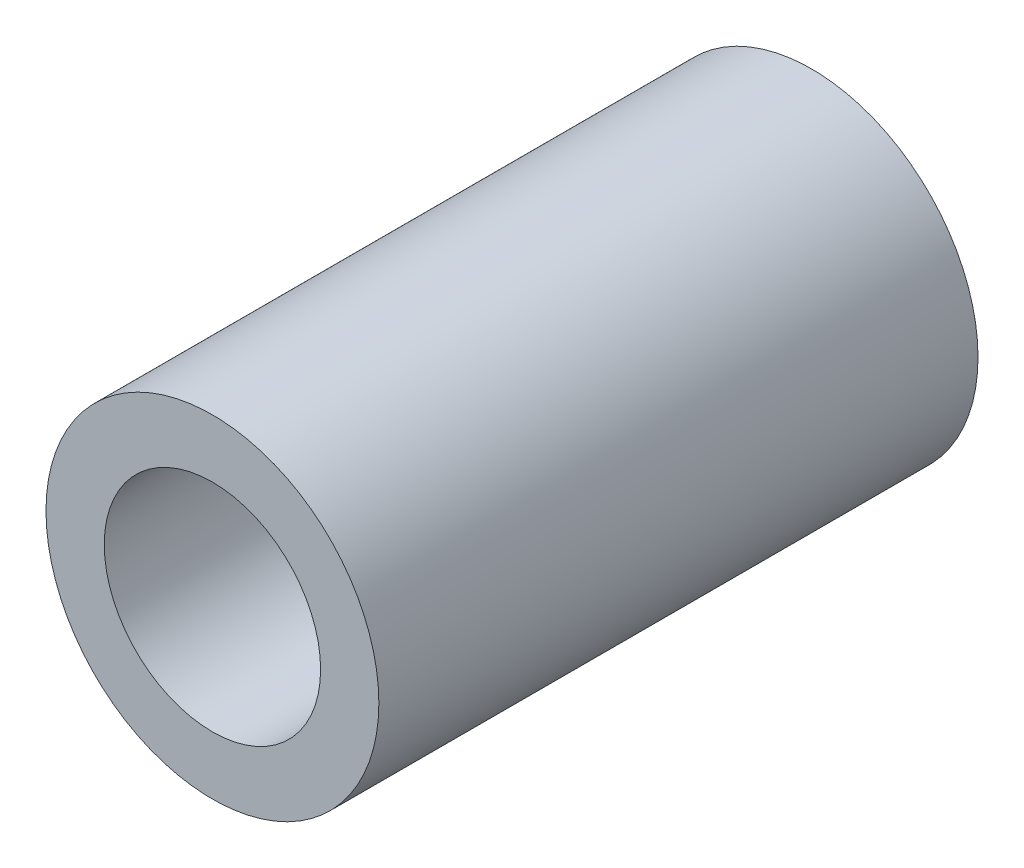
ISO-10303-21;
HEADER;
FILE_DESCRIPTION(('STEP AP214'),'2;1');
FILE_NAME('part.step','',(''),(''),'','','');
FILE_SCHEMA(('AUTOMOTIVE_DESIGN { 1 0 10303 214 1 1 1 1 }'));
ENDSEC;
DATA;
#1=APPLICATION_CONTEXT('core data for automotive mechanical design processes');
#2=APPLICATION_PROTOCOL_DEFINITION('international standard','automotive_design',2000,#1);
#3=PRODUCT_CONTEXT('',#1,'mechanical');
#4=PRODUCT('Part','Part','',(#3));
#5=PRODUCT_RELATED_PRODUCT_CATEGORY('part','',(#4));
#6=PRODUCT_DEFINITION_FORMATION('','',#4);
#7=PRODUCT_DEFINITION_CONTEXT('part definition',#1,'design');
#8=PRODUCT_DEFINITION('design','',#6,#7);
#9=PRODUCT_DEFINITION_SHAPE('','',#8);
#10=(LENGTH_UNIT() NAMED_UNIT(*) SI_UNIT(.MILLI.,.METRE.));
#11=(NAMED_UNIT(*) PLANE_ANGLE_UNIT() SI_UNIT($,.RADIAN.));
#12=(NAMED_UNIT(*) SI_UNIT($,.STERADIAN.) SOLID_ANGLE_UNIT());
#13=UNCERTAINTY_MEASURE_WITH_UNIT(LENGTH_MEASURE(1.E-05),#10,'distance_accuracy_value','');
#14=(GEOMETRIC_REPRESENTATION_CONTEXT(3) GLOBAL_UNCERTAINTY_ASSIGNED_CONTEXT((#13)) GLOBAL_UNIT_ASSIGNED_CONTEXT((#10,
#11,#12)) REPRESENTATION_CONTEXT('',''));
#15=CARTESIAN_POINT('',(0.,0.,0.));
#16=DIRECTION('',(0.,0.,1.));
#17=DIRECTION('',(1.,0.,0.));
#18=AXIS2_PLACEMENT_3D('',#15,#16,#17);
#19=CARTESIAN_POINT('',(0.,0.,18.));
#20=DIRECTION('',(0.,0.,1.));
#21=DIRECTION('',(1.,0.,0.));
#22=AXIS2_PLACEMENT_3D('',#19,#20,#21);
#23=PLANE('',#22);
#24=CARTESIAN_POINT('',(0.,0.,18.));
#25=DIRECTION('',(0.,0.,1.));
#26=DIRECTION('',(1.,0.,0.));
#27=AXIS2_PLACEMENT_3D('',#24,#25,#26);
#28=CIRCLE('',#27,5.);
#29=CARTESIAN_POINT('',(5.,0.,18.));
#30=VERTEX_POINT('',#29);
#31=EDGE_CURVE('E10',#30,#30,#28,.T.);
#32=ORIENTED_EDGE('',*,*,#31,.T.);
#33=EDGE_LOOP('',(#32));
#34=FACE_BOUND('',#33,.T.);
#35=CARTESIAN_POINT('',(0.,0.,18.));
#36=DIRECTION('',(0.,0.,1.));
#37=DIRECTION('',(1.,0.,0.));
#38=AXIS2_PLACEMENT_3D('',#35,#36,#37);
#39=CIRCLE('',#38,3.25);
#40=CARTESIAN_POINT('',(3.25,0.,18.));
#41=VERTEX_POINT('',#40);
#42=EDGE_CURVE('E40',#41,#41,#39,.T.);
#43=ORIENTED_EDGE('',*,*,#42,.F.);
#44=EDGE_LOOP('',(#43));
#45=FACE_BOUND('',#44,.T.);
#46=ADVANCED_FACE('F29',(#34,#45),#23,.T.);
#47=CARTESIAN_POINT('',(0.,0.,0.));
#48=DIRECTION('',(0.,0.,1.));
#49=DIRECTION('',(1.,0.,0.));
#50=AXIS2_PLACEMENT_3D('',#47,#48,#49);
#51=PLANE('',#50);
#52=CARTESIAN_POINT('',(0.,0.,0.));
#53=DIRECTION('',(0.,0.,1.));
#54=DIRECTION('',(1.,0.,0.));
#55=AXIS2_PLACEMENT_3D('',#52,#53,#54);
#56=CIRCLE('',#55,5.);
#57=CARTESIAN_POINT('',(5.,0.,0.));
#58=VERTEX_POINT('',#57);
#59=EDGE_CURVE('E33',#58,#58,#56,.T.);
#60=ORIENTED_EDGE('',*,*,#59,.F.);
#61=EDGE_LOOP('',(#60));
#62=FACE_BOUND('',#61,.T.);
#63=CARTESIAN_POINT('',(0.,0.,0.));
#64=DIRECTION('',(0.,0.,1.));
#65=DIRECTION('',(1.,0.,0.));
#66=AXIS2_PLACEMENT_3D('',#63,#64,#65);
#67=CIRCLE('',#66,3.25);
#68=CARTESIAN_POINT('',(3.25,0.,0.));
#69=VERTEX_POINT('',#68);
#70=EDGE_CURVE('E42',#69,#69,#67,.T.);
#71=ORIENTED_EDGE('',*,*,#70,.T.);
#72=EDGE_LOOP('',(#71));
#73=FACE_BOUND('',#72,.T.);
#74=ADVANCED_FACE('F52',(#62,#73),#51,.F.);
#75=CARTESIAN_POINT('',(0.,0.,18.));
#76=DIRECTION('',(0.,0.,-1.));
#77=DIRECTION('',(-1.,0.,0.));
#78=AXIS2_PLACEMENT_3D('',#75,#76,#77);
#79=CYLINDRICAL_SURFACE('',#78,5.);
#80=ORIENTED_EDGE('',*,*,#31,.F.);
#81=EDGE_LOOP('',(#80));
#82=FACE_BOUND('',#81,.T.);
#83=ORIENTED_EDGE('',*,*,#59,.T.);
#84=EDGE_LOOP('',(#83));
#85=FACE_BOUND('',#84,.T.);
#86=ADVANCED_FACE('F31',(#82,#85),#79,.T.);
#87=CARTESIAN_POINT('',(0.,0.,18.));
#88=DIRECTION('',(0.,0.,-1.));
#89=DIRECTION('',(-1.,0.,0.));
#90=AXIS2_PLACEMENT_3D('',#87,#88,#89);
#91=CYLINDRICAL_SURFACE('',#90,3.25);
#92=ORIENTED_EDGE('',*,*,#42,.T.);
#93=EDGE_LOOP('',(#92));
#94=FACE_BOUND('',#93,.T.);
#95=ORIENTED_EDGE('',*,*,#70,.F.);
#96=EDGE_LOOP('',(#95));
#97=FACE_BOUND('',#96,.T.);
#98=ADVANCED_FACE('F48',(#94,#97),#91,.F.);
#99=CLOSED_SHELL('',(#46,#74,#86,#98));
#100=MANIFOLD_SOLID_BREP('B2',#99);
#101=ADVANCED_BREP_SHAPE_REPRESENTATION('',(#18,#100),#14);
#102=SHAPE_DEFINITION_REPRESENTATION(#9,#101);
ENDSEC;
END-ISO-10303-21;
